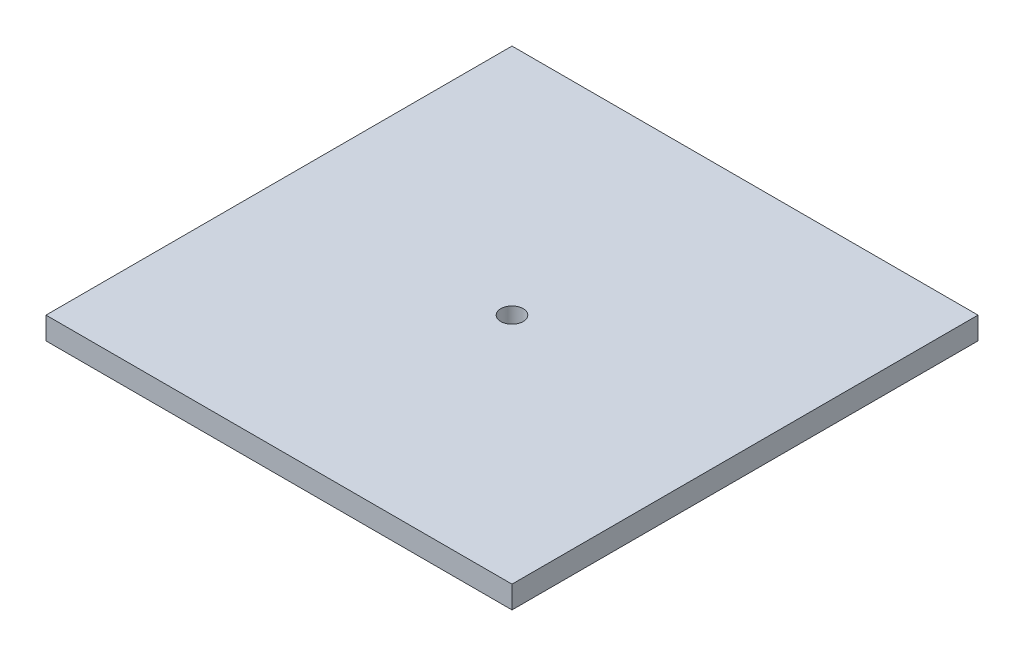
from build123d import *

# Parameters (mm, degrees)
ESQUISSE1_W      = 125
ESQUISSE1_H      = 125
ESQUISSE1_R      = 3
EXTRUSION1_DEPTH = 6


with BuildPart() as part:
    # Esquisse1 → Extrusion1 (new body)
    with BuildSketch(Plane(origin=(0, 0, 0), x_dir=(1, 0, 0), z_dir=(0, 1, 0))):
        with Locations((62.5, 62.5)):
            Rectangle(ESQUISSE1_W, ESQUISSE1_H)
        with Locations(Location((62.5, 62.5, 0), (0, 0, 270))):
            Circle(ESQUISSE1_R, mode=Mode.SUBTRACT)
    extrude(amount=EXTRUSION1_DEPTH)


solid = part.part
